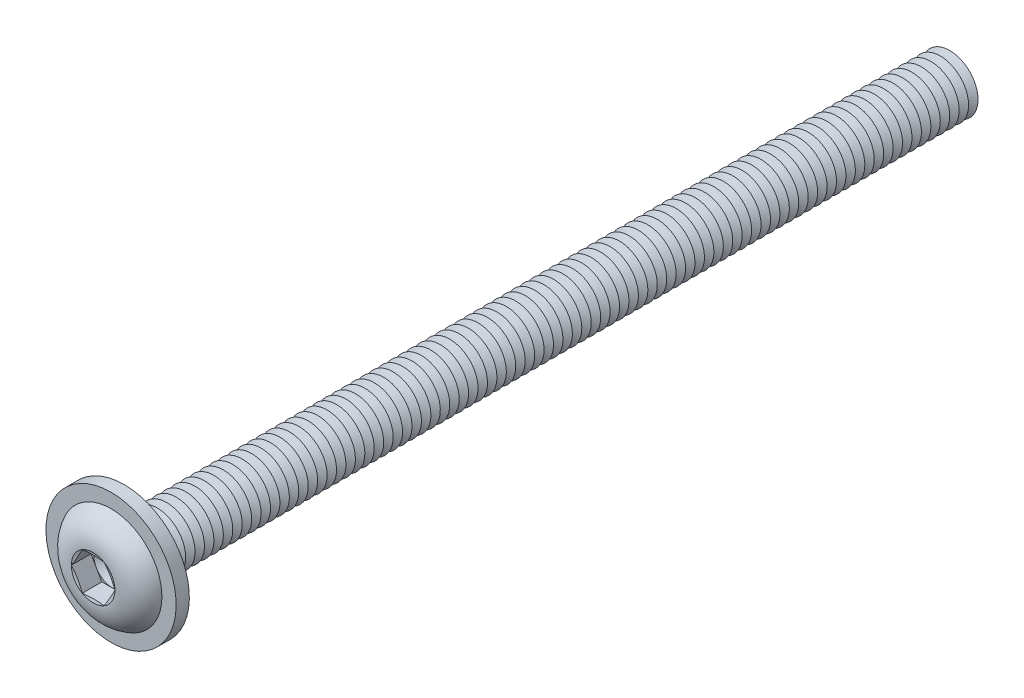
from build123d import *

# Parameters (mm, degrees)
FILLET1_R           = 0.25
LPATTERN1_COUNT     = 88
LPATTERN1_PITCH     = 0.5
CUT_EXTRUDE1_DEPTH  = 1.04
SKETCH5_R           = 3.45
SKETCH5_R_2         = 1.75
BOSS_EXTRUDE1_DEPTH = 0.7


with BuildPart() as part:
    # Sketch1 → Revolve1 (revolve)
    with BuildSketch(Plane(origin=(0, 0, 0), x_dir=(0, 0, -1), z_dir=(1, 0, 0))):
        with BuildLine():
            Line((0, 1.5), (0, 2.85))
            ThreePointArc((0, 2.85), (-1.182850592, 2.35063849), (-1.65, 1.1547))
            Line((-1.65, 1.1547), (-1.495299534, 0.57735))
            Line((-1.495299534, 0.57735), (-1.65, 0.57735))
            Line((-1.65, 0.57735), (-1.65, 0))
            Line((-1.65, 0), (44, 0))
            Line((44, 0), (44, 1.5))
            Line((44, 1.5), (0, 1.5))
        make_face()
    revolve(axis=Axis((0, 0, -44), (0, 0, 1)))

    # Fillet1
    fillet1_edges = [part.edges().sort_by_distance(p)[0] for p in [
        (0, -1.5, 0),
    ]]
    fillet(fillet1_edges, radius=FILLET1_R)

    # Sketch2 → Cut-Revolve1 (revolve, cut)
    with BuildSketch(Plane(origin=(0, 0, 0), x_dir=(0, 0, -1), z_dir=(1, 0, 0))):
        Polygon((43.75, 1.5), (44.25, 1.5), (44, 1.066987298), align=None)
    cut_revolve1 = revolve(axis=Axis((0, 0, -44), (0, 0, -1)), mode=Mode.SUBTRACT)

    # LPattern1: Cut-Revolve1 ×88
    with Locations(*[(0, 0, i * LPATTERN1_PITCH) for i in range(1, LPATTERN1_COUNT)]):
        add(cut_revolve1, mode=Mode.SUBTRACT)

    # Sketch3 → Cut-Extrude1 (cut)
    with BuildSketch(Plane.XY.offset(1.65)):
        Polygon((0.57735, 0.999999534), (-0.57735, 0.999999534), (-1.1547, 0), (-0.57735, -0.999999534), (0.57735, -0.999999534), (1.1547, 0), align=None)
    extrude(amount=-CUT_EXTRUDE1_DEPTH, mode=Mode.SUBTRACT)

    # Cut-Extrude2 cone 1 section (on through the dimple's axis) → Cut-Extrude2 (revolve, cut)
    with BuildSketch(Plane(origin=(0, 0, 0.61), x_dir=(0, -1, 0), z_dir=(1, 0, 0))):
        Polygon((0, 0), (0.999999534, 0), (0, 0.57735), align=None)
    revolve(axis=Axis((0, 0, 0.61), (0, 0, -1)), mode=Mode.SUBTRACT)

    # Sketch5 → Boss-Extrude1 (add)
    with BuildSketch(Plane(origin=(0, 0, 0), x_dir=(-1, 0, 0), z_dir=(0, 0, -1))):
        with Locations(Location((0, 0, 0), (0, 0, 90))):
            Circle(SKETCH5_R)
        Circle(SKETCH5_R_2, mode=Mode.SUBTRACT)
    extrude(amount=-BOSS_EXTRUDE1_DEPTH)


solid = part.part
